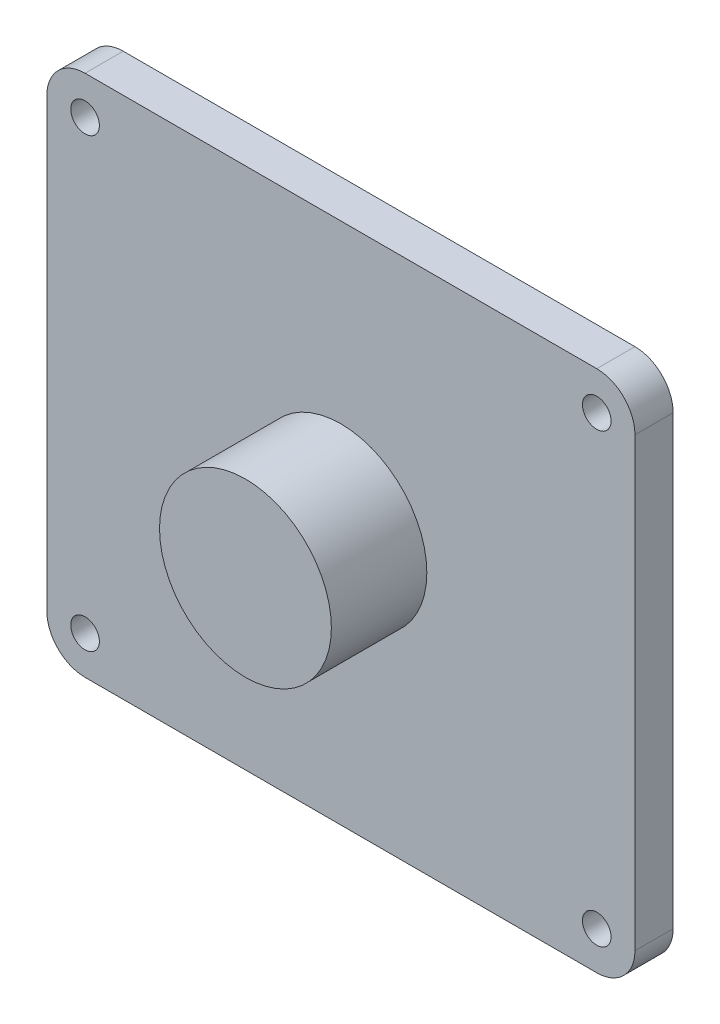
ISO-10303-21;
HEADER;
FILE_DESCRIPTION(('STEP AP214'),'2;1');
FILE_NAME('part.step','',(''),(''),'','','');
FILE_SCHEMA(('AUTOMOTIVE_DESIGN { 1 0 10303 214 1 1 1 1 }'));
ENDSEC;
DATA;
#1=APPLICATION_CONTEXT('core data for automotive mechanical design processes');
#2=APPLICATION_PROTOCOL_DEFINITION('international standard','automotive_design',2000,#1);
#3=PRODUCT_CONTEXT('',#1,'mechanical');
#4=PRODUCT('Part','Part','',(#3));
#5=PRODUCT_RELATED_PRODUCT_CATEGORY('part','',(#4));
#6=PRODUCT_DEFINITION_FORMATION('','',#4);
#7=PRODUCT_DEFINITION_CONTEXT('part definition',#1,'design');
#8=PRODUCT_DEFINITION('design','',#6,#7);
#9=PRODUCT_DEFINITION_SHAPE('','',#8);
#10=(LENGTH_UNIT() NAMED_UNIT(*) SI_UNIT(.MILLI.,.METRE.));
#11=(NAMED_UNIT(*) PLANE_ANGLE_UNIT() SI_UNIT($,.RADIAN.));
#12=(NAMED_UNIT(*) SI_UNIT($,.STERADIAN.) SOLID_ANGLE_UNIT());
#13=UNCERTAINTY_MEASURE_WITH_UNIT(LENGTH_MEASURE(1.E-05),#10,'distance_accuracy_value','');
#14=(GEOMETRIC_REPRESENTATION_CONTEXT(3) GLOBAL_UNCERTAINTY_ASSIGNED_CONTEXT((#13)) GLOBAL_UNIT_ASSIGNED_CONTEXT((#10,
#11,#12)) REPRESENTATION_CONTEXT('',''));
#15=CARTESIAN_POINT('',(0.,0.,0.));
#16=DIRECTION('',(0.,0.,1.));
#17=DIRECTION('',(1.,0.,0.));
#18=AXIS2_PLACEMENT_3D('',#15,#16,#17);
#19=CARTESIAN_POINT('',(76.9999999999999,-68.5000000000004,10.));
#20=DIRECTION('',(0.,0.,1.));
#21=DIRECTION('',(1.,0.,0.));
#22=AXIS2_PLACEMENT_3D('',#19,#20,#21);
#23=PLANE('',#22);
#24=CARTESIAN_POINT('',(-66.9999999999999,-58.5000000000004,10.));
#25=DIRECTION('',(0.,0.,1.));
#26=DIRECTION('',(1.,0.,0.));
#27=AXIS2_PLACEMENT_3D('',#24,#25,#26);
#28=CIRCLE('',#27,3.74999999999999);
#29=CARTESIAN_POINT('',(-63.2499999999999,-58.5000000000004,10.));
#30=VERTEX_POINT('',#29);
#31=EDGE_CURVE('E178',#30,#30,#28,.T.);
#32=ORIENTED_EDGE('',*,*,#31,.F.);
#33=EDGE_LOOP('',(#32));
#34=FACE_BOUND('',#33,.T.);
#35=CARTESIAN_POINT('',(-66.9999999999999,58.5000000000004,10.));
#36=DIRECTION('',(0.,0.,1.));
#37=DIRECTION('',(1.,0.,0.));
#38=AXIS2_PLACEMENT_3D('',#35,#36,#37);
#39=CIRCLE('',#38,3.74999999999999);
#40=CARTESIAN_POINT('',(-63.2499999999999,58.5000000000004,10.));
#41=VERTEX_POINT('',#40);
#42=EDGE_CURVE('E168',#41,#41,#39,.T.);
#43=ORIENTED_EDGE('',*,*,#42,.F.);
#44=EDGE_LOOP('',(#43));
#45=FACE_BOUND('',#44,.T.);
#46=CARTESIAN_POINT('',(66.9999999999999,58.5000000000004,10.));
#47=DIRECTION('',(0.,0.,1.));
#48=DIRECTION('',(1.,0.,0.));
#49=AXIS2_PLACEMENT_3D('',#46,#47,#48);
#50=CIRCLE('',#49,3.75);
#51=CARTESIAN_POINT('',(70.7499999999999,58.5000000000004,10.));
#52=VERTEX_POINT('',#51);
#53=EDGE_CURVE('E165',#52,#52,#50,.T.);
#54=ORIENTED_EDGE('',*,*,#53,.F.);
#55=EDGE_LOOP('',(#54));
#56=FACE_BOUND('',#55,.T.);
#57=CARTESIAN_POINT('',(66.9999999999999,-58.5000000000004,10.));
#58=DIRECTION('',(0.,0.,1.));
#59=DIRECTION('',(1.,0.,0.));
#60=AXIS2_PLACEMENT_3D('',#57,#58,#59);
#61=CIRCLE('',#60,3.74999999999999);
#62=CARTESIAN_POINT('',(70.7499999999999,-58.5000000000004,10.));
#63=VERTEX_POINT('',#62);
#64=EDGE_CURVE('E162',#63,#63,#61,.T.);
#65=ORIENTED_EDGE('',*,*,#64,.F.);
#66=EDGE_LOOP('',(#65));
#67=FACE_BOUND('',#66,.T.);
#68=DIRECTION('',(1.,0.,0.));
#69=VECTOR('',#68,1.);
#70=CARTESIAN_POINT('',(-76.9999999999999,-68.5000000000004,10.));
#71=LINE('',#70,#69);
#72=CARTESIAN_POINT('',(-66.9999999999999,-68.5000000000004,10.));
#73=VERTEX_POINT('',#72);
#74=CARTESIAN_POINT('',(66.9999999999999,-68.5000000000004,10.));
#75=VERTEX_POINT('',#74);
#76=EDGE_CURVE('E134',#73,#75,#71,.T.);
#77=ORIENTED_EDGE('',*,*,#76,.T.);
#78=CARTESIAN_POINT('',(66.9999999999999,-58.5000000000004,10.));
#79=DIRECTION('',(0.,0.,1.));
#80=DIRECTION('',(1.,0.,0.));
#81=AXIS2_PLACEMENT_3D('',#78,#79,#80);
#82=CIRCLE('',#81,10.);
#83=CARTESIAN_POINT('',(76.9999999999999,-58.5000000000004,10.));
#84=VERTEX_POINT('',#83);
#85=EDGE_CURVE('E149',#75,#84,#82,.T.);
#86=ORIENTED_EDGE('',*,*,#85,.T.);
#87=DIRECTION('',(0.,1.,0.));
#88=VECTOR('',#87,1.);
#89=CARTESIAN_POINT('',(76.9999999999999,-68.5000000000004,10.));
#90=LINE('',#89,#88);
#91=CARTESIAN_POINT('',(76.9999999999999,58.5000000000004,10.));
#92=VERTEX_POINT('',#91);
#93=EDGE_CURVE('E117',#84,#92,#90,.T.);
#94=ORIENTED_EDGE('',*,*,#93,.T.);
#95=CARTESIAN_POINT('',(66.9999999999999,58.5000000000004,10.));
#96=DIRECTION('',(0.,0.,1.));
#97=DIRECTION('',(1.,0.,0.));
#98=AXIS2_PLACEMENT_3D('',#95,#96,#97);
#99=CIRCLE('',#98,10.);
#100=CARTESIAN_POINT('',(66.9999999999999,68.5000000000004,10.));
#101=VERTEX_POINT('',#100);
#102=EDGE_CURVE('E147',#92,#101,#99,.T.);
#103=ORIENTED_EDGE('',*,*,#102,.T.);
#104=DIRECTION('',(1.,0.,0.));
#105=VECTOR('',#104,1.);
#106=CARTESIAN_POINT('',(-76.9999999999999,68.5000000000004,10.));
#107=LINE('',#106,#105);
#108=CARTESIAN_POINT('',(-66.9999999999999,68.5000000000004,10.));
#109=VERTEX_POINT('',#108);
#110=EDGE_CURVE('E190',#109,#101,#107,.T.);
#111=ORIENTED_EDGE('',*,*,#110,.F.);
#112=CARTESIAN_POINT('',(-66.9999999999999,58.5000000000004,10.));
#113=DIRECTION('',(0.,0.,1.));
#114=DIRECTION('',(1.,0.,0.));
#115=AXIS2_PLACEMENT_3D('',#112,#113,#114);
#116=CIRCLE('',#115,10.);
#117=CARTESIAN_POINT('',(-76.9999999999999,58.5000000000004,10.));
#118=VERTEX_POINT('',#117);
#119=EDGE_CURVE('E47',#109,#118,#116,.T.);
#120=ORIENTED_EDGE('',*,*,#119,.T.);
#121=DIRECTION('',(0.,1.,0.));
#122=VECTOR('',#121,1.);
#123=CARTESIAN_POINT('',(-76.9999999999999,-68.5000000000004,10.));
#124=LINE('',#123,#122);
#125=CARTESIAN_POINT('',(-76.9999999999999,-58.5000000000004,10.));
#126=VERTEX_POINT('',#125);
#127=EDGE_CURVE('E135',#126,#118,#124,.T.);
#128=ORIENTED_EDGE('',*,*,#127,.F.);
#129=CARTESIAN_POINT('',(-66.9999999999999,-58.5000000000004,10.));
#130=DIRECTION('',(0.,0.,1.));
#131=DIRECTION('',(1.,0.,0.));
#132=AXIS2_PLACEMENT_3D('',#129,#130,#131);
#133=CIRCLE('',#132,10.);
#134=EDGE_CURVE('E145',#126,#73,#133,.T.);
#135=ORIENTED_EDGE('',*,*,#134,.T.);
#136=EDGE_LOOP('',(#77,#86,#94,#103,#111,#120,#128,#135));
#137=FACE_BOUND('',#136,.T.);
#138=CARTESIAN_POINT('',(0.,0.,10.));
#139=DIRECTION('',(0.,0.,1.));
#140=DIRECTION('',(1.,0.,0.));
#141=AXIS2_PLACEMENT_3D('',#138,#139,#140);
#142=CIRCLE('',#141,22.5);
#143=CARTESIAN_POINT('',(22.5,0.,10.));
#144=VERTEX_POINT('',#143);
#145=EDGE_CURVE('E128',#144,#144,#142,.F.);
#146=ORIENTED_EDGE('',*,*,#145,.T.);
#147=EDGE_LOOP('',(#146));
#148=FACE_BOUND('',#147,.T.);
#149=ADVANCED_FACE('F30',(#34,#45,#56,#67,#137,#148),#23,.T.);
#150=CARTESIAN_POINT('',(-76.9999999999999,-68.5000000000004,10.));
#151=DIRECTION('',(0.,1.,0.));
#152=DIRECTION('',(0.,0.,1.));
#153=AXIS2_PLACEMENT_3D('',#150,#151,#152);
#154=PLANE('',#153);
#155=DIRECTION('',(1.,0.,0.));
#156=VECTOR('',#155,1.);
#157=CARTESIAN_POINT('',(-76.9999999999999,-68.5000000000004,0.));
#158=LINE('',#157,#156);
#159=CARTESIAN_POINT('',(-66.9999999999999,-68.5000000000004,0.));
#160=VERTEX_POINT('',#159);
#161=CARTESIAN_POINT('',(66.9999999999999,-68.5000000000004,0.));
#162=VERTEX_POINT('',#161);
#163=EDGE_CURVE('E124',#160,#162,#158,.T.);
#164=ORIENTED_EDGE('',*,*,#163,.T.);
#165=DIRECTION('',(0.,0.,-1.));
#166=VECTOR('',#165,1.);
#167=CARTESIAN_POINT('',(66.9999999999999,-68.5000000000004,10.));
#168=LINE('',#167,#166);
#169=EDGE_CURVE('E102',#162,#75,#168,.F.);
#170=ORIENTED_EDGE('',*,*,#169,.T.);
#171=ORIENTED_EDGE('',*,*,#76,.F.);
#172=DIRECTION('',(0.,0.,-1.));
#173=VECTOR('',#172,1.);
#174=CARTESIAN_POINT('',(-66.9999999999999,-68.5000000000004,0.));
#175=LINE('',#174,#173);
#176=EDGE_CURVE('E107',#73,#160,#175,.T.);
#177=ORIENTED_EDGE('',*,*,#176,.T.);
#178=EDGE_LOOP('',(#164,#170,#171,#177));
#179=FACE_BOUND('',#178,.T.);
#180=ADVANCED_FACE('F208',(#179),#154,.F.);
#181=CARTESIAN_POINT('',(76.9999999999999,-68.5000000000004,10.));
#182=DIRECTION('',(-1.,0.,0.));
#183=DIRECTION('',(0.,0.,1.));
#184=AXIS2_PLACEMENT_3D('',#181,#182,#183);
#185=PLANE('',#184);
#186=ORIENTED_EDGE('',*,*,#93,.F.);
#187=DIRECTION('',(0.,0.,-1.));
#188=VECTOR('',#187,1.);
#189=CARTESIAN_POINT('',(76.9999999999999,-58.5000000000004,10.));
#190=LINE('',#189,#188);
#191=CARTESIAN_POINT('',(76.9999999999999,-58.5000000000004,0.));
#192=VERTEX_POINT('',#191);
#193=EDGE_CURVE('E101',#84,#192,#190,.T.);
#194=ORIENTED_EDGE('',*,*,#193,.T.);
#195=DIRECTION('',(0.,1.,0.));
#196=VECTOR('',#195,1.);
#197=CARTESIAN_POINT('',(76.9999999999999,-68.5000000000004,0.));
#198=LINE('',#197,#196);
#199=CARTESIAN_POINT('',(76.9999999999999,58.5000000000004,0.));
#200=VERTEX_POINT('',#199);
#201=EDGE_CURVE('E114',#192,#200,#198,.T.);
#202=ORIENTED_EDGE('',*,*,#201,.T.);
#203=DIRECTION('',(0.,0.,-1.));
#204=VECTOR('',#203,1.);
#205=CARTESIAN_POINT('',(76.9999999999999,58.5000000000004,10.));
#206=LINE('',#205,#204);
#207=EDGE_CURVE('E119',#200,#92,#206,.F.);
#208=ORIENTED_EDGE('',*,*,#207,.T.);
#209=EDGE_LOOP('',(#186,#194,#202,#208));
#210=FACE_BOUND('',#209,.T.);
#211=ADVANCED_FACE('F113',(#210),#185,.F.);
#212=CARTESIAN_POINT('',(-76.9999999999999,68.5000000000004,10.));
#213=DIRECTION('',(0.,1.,0.));
#214=DIRECTION('',(0.,0.,1.));
#215=AXIS2_PLACEMENT_3D('',#212,#213,#214);
#216=PLANE('',#215);
#217=ORIENTED_EDGE('',*,*,#110,.T.);
#218=DIRECTION('',(0.,0.,-1.));
#219=VECTOR('',#218,1.);
#220=CARTESIAN_POINT('',(66.9999999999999,68.5000000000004,0.));
#221=LINE('',#220,#219);
#222=CARTESIAN_POINT('',(66.9999999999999,68.5000000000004,0.));
#223=VERTEX_POINT('',#222);
#224=EDGE_CURVE('E153',#101,#223,#221,.T.);
#225=ORIENTED_EDGE('',*,*,#224,.T.);
#226=DIRECTION('',(1.,0.,0.));
#227=VECTOR('',#226,1.);
#228=CARTESIAN_POINT('',(-76.9999999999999,68.5000000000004,0.));
#229=LINE('',#228,#227);
#230=CARTESIAN_POINT('',(-66.9999999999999,68.5000000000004,0.));
#231=VERTEX_POINT('',#230);
#232=EDGE_CURVE('E123',#231,#223,#229,.T.);
#233=ORIENTED_EDGE('',*,*,#232,.F.);
#234=DIRECTION('',(0.,0.,-1.));
#235=VECTOR('',#234,1.);
#236=CARTESIAN_POINT('',(-66.9999999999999,68.5000000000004,10.));
#237=LINE('',#236,#235);
#238=EDGE_CURVE('E151',#231,#109,#237,.F.);
#239=ORIENTED_EDGE('',*,*,#238,.T.);
#240=EDGE_LOOP('',(#217,#225,#233,#239));
#241=FACE_BOUND('',#240,.T.);
#242=ADVANCED_FACE('F199',(#241),#216,.T.);
#243=CARTESIAN_POINT('',(-76.9999999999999,-68.5000000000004,10.));
#244=DIRECTION('',(-1.,0.,0.));
#245=DIRECTION('',(0.,0.,1.));
#246=AXIS2_PLACEMENT_3D('',#243,#244,#245);
#247=PLANE('',#246);
#248=DIRECTION('',(0.,1.,0.));
#249=VECTOR('',#248,1.);
#250=CARTESIAN_POINT('',(-76.9999999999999,-68.5000000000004,0.));
#251=LINE('',#250,#249);
#252=CARTESIAN_POINT('',(-76.9999999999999,-58.5000000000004,0.));
#253=VERTEX_POINT('',#252);
#254=CARTESIAN_POINT('',(-76.9999999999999,58.5000000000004,0.));
#255=VERTEX_POINT('',#254);
#256=EDGE_CURVE('E126',#253,#255,#251,.T.);
#257=ORIENTED_EDGE('',*,*,#256,.F.);
#258=DIRECTION('',(0.,0.,-1.));
#259=VECTOR('',#258,1.);
#260=CARTESIAN_POINT('',(-76.9999999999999,-58.5000000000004,10.));
#261=LINE('',#260,#259);
#262=EDGE_CURVE('E11',#253,#126,#261,.F.);
#263=ORIENTED_EDGE('',*,*,#262,.T.);
#264=ORIENTED_EDGE('',*,*,#127,.T.);
#265=DIRECTION('',(0.,0.,-1.));
#266=VECTOR('',#265,1.);
#267=CARTESIAN_POINT('',(-76.9999999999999,58.5000000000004,10.));
#268=LINE('',#267,#266);
#269=EDGE_CURVE('E39',#118,#255,#268,.T.);
#270=ORIENTED_EDGE('',*,*,#269,.T.);
#271=EDGE_LOOP('',(#257,#263,#264,#270));
#272=FACE_BOUND('',#271,.T.);
#273=ADVANCED_FACE('F193',(#272),#247,.T.);
#274=CARTESIAN_POINT('',(76.9999999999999,-68.5000000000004,0.));
#275=DIRECTION('',(0.,0.,1.));
#276=DIRECTION('',(1.,0.,0.));
#277=AXIS2_PLACEMENT_3D('',#274,#275,#276);
#278=PLANE('',#277);
#279=CARTESIAN_POINT('',(-66.9999999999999,-58.5000000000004,0.));
#280=DIRECTION('',(0.,0.,1.));
#281=DIRECTION('',(1.,0.,0.));
#282=AXIS2_PLACEMENT_3D('',#279,#280,#281);
#283=CIRCLE('',#282,3.74999999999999);
#284=CARTESIAN_POINT('',(-63.2499999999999,-58.5000000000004,0.));
#285=VERTEX_POINT('',#284);
#286=EDGE_CURVE('E34',#285,#285,#283,.T.);
#287=ORIENTED_EDGE('',*,*,#286,.T.);
#288=EDGE_LOOP('',(#287));
#289=FACE_BOUND('',#288,.T.);
#290=CARTESIAN_POINT('',(-66.9999999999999,58.5000000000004,0.));
#291=DIRECTION('',(0.,0.,1.));
#292=DIRECTION('',(1.,0.,0.));
#293=AXIS2_PLACEMENT_3D('',#290,#291,#292);
#294=CIRCLE('',#293,3.74999999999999);
#295=CARTESIAN_POINT('',(-63.2499999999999,58.5000000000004,0.));
#296=VERTEX_POINT('',#295);
#297=EDGE_CURVE('E166',#296,#296,#294,.T.);
#298=ORIENTED_EDGE('',*,*,#297,.T.);
#299=EDGE_LOOP('',(#298));
#300=FACE_BOUND('',#299,.T.);
#301=CARTESIAN_POINT('',(66.9999999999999,58.5000000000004,0.));
#302=DIRECTION('',(0.,0.,1.));
#303=DIRECTION('',(1.,0.,0.));
#304=AXIS2_PLACEMENT_3D('',#301,#302,#303);
#305=CIRCLE('',#304,3.75);
#306=CARTESIAN_POINT('',(70.7499999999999,58.5000000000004,0.));
#307=VERTEX_POINT('',#306);
#308=EDGE_CURVE('E163',#307,#307,#305,.T.);
#309=ORIENTED_EDGE('',*,*,#308,.T.);
#310=EDGE_LOOP('',(#309));
#311=FACE_BOUND('',#310,.T.);
#312=CARTESIAN_POINT('',(66.9999999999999,-58.5000000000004,0.));
#313=DIRECTION('',(0.,0.,1.));
#314=DIRECTION('',(1.,0.,0.));
#315=AXIS2_PLACEMENT_3D('',#312,#313,#314);
#316=CIRCLE('',#315,3.74999999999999);
#317=CARTESIAN_POINT('',(70.7499999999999,-58.5000000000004,0.));
#318=VERTEX_POINT('',#317);
#319=EDGE_CURVE('E158',#318,#318,#316,.T.);
#320=ORIENTED_EDGE('',*,*,#319,.T.);
#321=EDGE_LOOP('',(#320));
#322=FACE_BOUND('',#321,.T.);
#323=ORIENTED_EDGE('',*,*,#201,.F.);
#324=CARTESIAN_POINT('',(66.9999999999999,-58.5000000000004,0.));
#325=DIRECTION('',(0.,0.,1.));
#326=DIRECTION('',(1.,0.,0.));
#327=AXIS2_PLACEMENT_3D('',#324,#325,#326);
#328=CIRCLE('',#327,10.);
#329=EDGE_CURVE('E97',#192,#162,#328,.F.);
#330=ORIENTED_EDGE('',*,*,#329,.T.);
#331=ORIENTED_EDGE('',*,*,#163,.F.);
#332=CARTESIAN_POINT('',(-66.9999999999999,-58.5000000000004,0.));
#333=DIRECTION('',(0.,0.,1.));
#334=DIRECTION('',(1.,0.,0.));
#335=AXIS2_PLACEMENT_3D('',#332,#333,#334);
#336=CIRCLE('',#335,10.);
#337=EDGE_CURVE('E138',#160,#253,#336,.F.);
#338=ORIENTED_EDGE('',*,*,#337,.T.);
#339=ORIENTED_EDGE('',*,*,#256,.T.);
#340=CARTESIAN_POINT('',(-66.9999999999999,58.5000000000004,0.));
#341=DIRECTION('',(0.,0.,1.));
#342=DIRECTION('',(1.,0.,0.));
#343=AXIS2_PLACEMENT_3D('',#340,#341,#342);
#344=CIRCLE('',#343,10.);
#345=EDGE_CURVE('E118',#255,#231,#344,.F.);
#346=ORIENTED_EDGE('',*,*,#345,.T.);
#347=ORIENTED_EDGE('',*,*,#232,.T.);
#348=CARTESIAN_POINT('',(66.9999999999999,58.5000000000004,0.));
#349=DIRECTION('',(0.,0.,1.));
#350=DIRECTION('',(1.,0.,0.));
#351=AXIS2_PLACEMENT_3D('',#348,#349,#350);
#352=CIRCLE('',#351,10.);
#353=EDGE_CURVE('E108',#223,#200,#352,.F.);
#354=ORIENTED_EDGE('',*,*,#353,.T.);
#355=EDGE_LOOP('',(#323,#330,#331,#338,#339,#346,#347,#354));
#356=FACE_BOUND('',#355,.T.);
#357=ADVANCED_FACE('F121',(#289,#300,#311,#322,#356),#278,.F.);
#358=CARTESIAN_POINT('',(0.,0.,35.));
#359=DIRECTION('',(0.,0.,-1.));
#360=DIRECTION('',(-1.,0.,0.));
#361=AXIS2_PLACEMENT_3D('',#358,#359,#360);
#362=CYLINDRICAL_SURFACE('',#361,22.5);
#363=ORIENTED_EDGE('',*,*,#145,.F.);
#364=EDGE_LOOP('',(#363));
#365=FACE_BOUND('',#364,.T.);
#366=CARTESIAN_POINT('',(0.,0.,35.));
#367=DIRECTION('',(0.,0.,1.));
#368=DIRECTION('',(1.,0.,0.));
#369=AXIS2_PLACEMENT_3D('',#366,#367,#368);
#370=CIRCLE('',#369,22.5);
#371=CARTESIAN_POINT('',(22.5,0.,35.));
#372=VERTEX_POINT('',#371);
#373=EDGE_CURVE('E161',#372,#372,#370,.T.);
#374=ORIENTED_EDGE('',*,*,#373,.F.);
#375=EDGE_LOOP('',(#374));
#376=FACE_BOUND('',#375,.T.);
#377=ADVANCED_FACE('F229',(#365,#376),#362,.T.);
#378=CARTESIAN_POINT('',(0.,0.,35.));
#379=DIRECTION('',(0.,0.,1.));
#380=DIRECTION('',(1.,0.,0.));
#381=AXIS2_PLACEMENT_3D('',#378,#379,#380);
#382=PLANE('',#381);
#383=ORIENTED_EDGE('',*,*,#373,.T.);
#384=EDGE_LOOP('',(#383));
#385=FACE_BOUND('',#384,.T.);
#386=ADVANCED_FACE('F241',(#385),#382,.T.);
#387=CARTESIAN_POINT('',(66.9999999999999,-58.5000000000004,10.));
#388=DIRECTION('',(0.,0.,-1.));
#389=DIRECTION('',(-1.,0.,0.));
#390=AXIS2_PLACEMENT_3D('',#387,#388,#389);
#391=CYLINDRICAL_SURFACE('',#390,10.);
#392=ORIENTED_EDGE('',*,*,#85,.F.);
#393=ORIENTED_EDGE('',*,*,#169,.F.);
#394=ORIENTED_EDGE('',*,*,#329,.F.);
#395=ORIENTED_EDGE('',*,*,#193,.F.);
#396=EDGE_LOOP('',(#392,#393,#394,#395));
#397=FACE_BOUND('',#396,.T.);
#398=ADVANCED_FACE('F100',(#397),#391,.T.);
#399=CARTESIAN_POINT('',(66.9999999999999,58.5000000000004,10.));
#400=DIRECTION('',(0.,0.,1.));
#401=DIRECTION('',(1.,0.,0.));
#402=AXIS2_PLACEMENT_3D('',#399,#400,#401);
#403=CYLINDRICAL_SURFACE('',#402,10.);
#404=ORIENTED_EDGE('',*,*,#102,.F.);
#405=ORIENTED_EDGE('',*,*,#207,.F.);
#406=ORIENTED_EDGE('',*,*,#353,.F.);
#407=ORIENTED_EDGE('',*,*,#224,.F.);
#408=EDGE_LOOP('',(#404,#405,#406,#407));
#409=FACE_BOUND('',#408,.T.);
#410=ADVANCED_FACE('F203',(#409),#403,.T.);
#411=CARTESIAN_POINT('',(-66.9999999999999,-58.5000000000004,10.));
#412=DIRECTION('',(0.,0.,1.));
#413=DIRECTION('',(1.,0.,0.));
#414=AXIS2_PLACEMENT_3D('',#411,#412,#413);
#415=CYLINDRICAL_SURFACE('',#414,10.);
#416=ORIENTED_EDGE('',*,*,#134,.F.);
#417=ORIENTED_EDGE('',*,*,#262,.F.);
#418=ORIENTED_EDGE('',*,*,#337,.F.);
#419=ORIENTED_EDGE('',*,*,#176,.F.);
#420=EDGE_LOOP('',(#416,#417,#418,#419));
#421=FACE_BOUND('',#420,.T.);
#422=ADVANCED_FACE('F210',(#421),#415,.T.);
#423=CARTESIAN_POINT('',(-66.9999999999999,58.5000000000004,10.));
#424=DIRECTION('',(0.,0.,-1.));
#425=DIRECTION('',(-1.,0.,0.));
#426=AXIS2_PLACEMENT_3D('',#423,#424,#425);
#427=CYLINDRICAL_SURFACE('',#426,10.);
#428=ORIENTED_EDGE('',*,*,#119,.F.);
#429=ORIENTED_EDGE('',*,*,#238,.F.);
#430=ORIENTED_EDGE('',*,*,#345,.F.);
#431=ORIENTED_EDGE('',*,*,#269,.F.);
#432=EDGE_LOOP('',(#428,#429,#430,#431));
#433=FACE_BOUND('',#432,.T.);
#434=ADVANCED_FACE('F32',(#433),#427,.T.);
#435=CARTESIAN_POINT('',(66.9999999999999,-58.5000000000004,10.));
#436=DIRECTION('',(0.,0.,1.));
#437=DIRECTION('',(1.,0.,0.));
#438=AXIS2_PLACEMENT_3D('',#435,#436,#437);
#439=CYLINDRICAL_SURFACE('',#438,3.74999999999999);
#440=ORIENTED_EDGE('',*,*,#64,.T.);
#441=EDGE_LOOP('',(#440));
#442=FACE_BOUND('',#441,.T.);
#443=ORIENTED_EDGE('',*,*,#319,.F.);
#444=EDGE_LOOP('',(#443));
#445=FACE_BOUND('',#444,.T.);
#446=ADVANCED_FACE('F216',(#442,#445),#439,.F.);
#447=CARTESIAN_POINT('',(66.9999999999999,58.5000000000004,10.));
#448=DIRECTION('',(0.,0.,1.));
#449=DIRECTION('',(1.,0.,0.));
#450=AXIS2_PLACEMENT_3D('',#447,#448,#449);
#451=CYLINDRICAL_SURFACE('',#450,3.75);
#452=ORIENTED_EDGE('',*,*,#53,.T.);
#453=EDGE_LOOP('',(#452));
#454=FACE_BOUND('',#453,.T.);
#455=ORIENTED_EDGE('',*,*,#308,.F.);
#456=EDGE_LOOP('',(#455));
#457=FACE_BOUND('',#456,.T.);
#458=ADVANCED_FACE('F253',(#454,#457),#451,.F.);
#459=CARTESIAN_POINT('',(-66.9999999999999,58.5000000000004,10.));
#460=DIRECTION('',(0.,0.,1.));
#461=DIRECTION('',(1.,0.,0.));
#462=AXIS2_PLACEMENT_3D('',#459,#460,#461);
#463=CYLINDRICAL_SURFACE('',#462,3.74999999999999);
#464=ORIENTED_EDGE('',*,*,#42,.T.);
#465=EDGE_LOOP('',(#464));
#466=FACE_BOUND('',#465,.T.);
#467=ORIENTED_EDGE('',*,*,#297,.F.);
#468=EDGE_LOOP('',(#467));
#469=FACE_BOUND('',#468,.T.);
#470=ADVANCED_FACE('F257',(#466,#469),#463,.F.);
#471=CARTESIAN_POINT('',(-66.9999999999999,-58.5000000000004,10.));
#472=DIRECTION('',(0.,0.,1.));
#473=DIRECTION('',(1.,0.,0.));
#474=AXIS2_PLACEMENT_3D('',#471,#472,#473);
#475=CYLINDRICAL_SURFACE('',#474,3.74999999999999);
#476=ORIENTED_EDGE('',*,*,#31,.T.);
#477=EDGE_LOOP('',(#476));
#478=FACE_BOUND('',#477,.T.);
#479=ORIENTED_EDGE('',*,*,#286,.F.);
#480=EDGE_LOOP('',(#479));
#481=FACE_BOUND('',#480,.T.);
#482=ADVANCED_FACE('F261',(#478,#481),#475,.F.);
#483=CLOSED_SHELL('',(#149,#180,#211,#242,#273,#357,#377,#386,#398,#410,#422,#434,#446,#458,
#470,#482));
#484=MANIFOLD_SOLID_BREP('B2',#483);
#485=ADVANCED_BREP_SHAPE_REPRESENTATION('',(#18,#484),#14);
#486=SHAPE_DEFINITION_REPRESENTATION(#9,#485);
ENDSEC;
END-ISO-10303-21;
